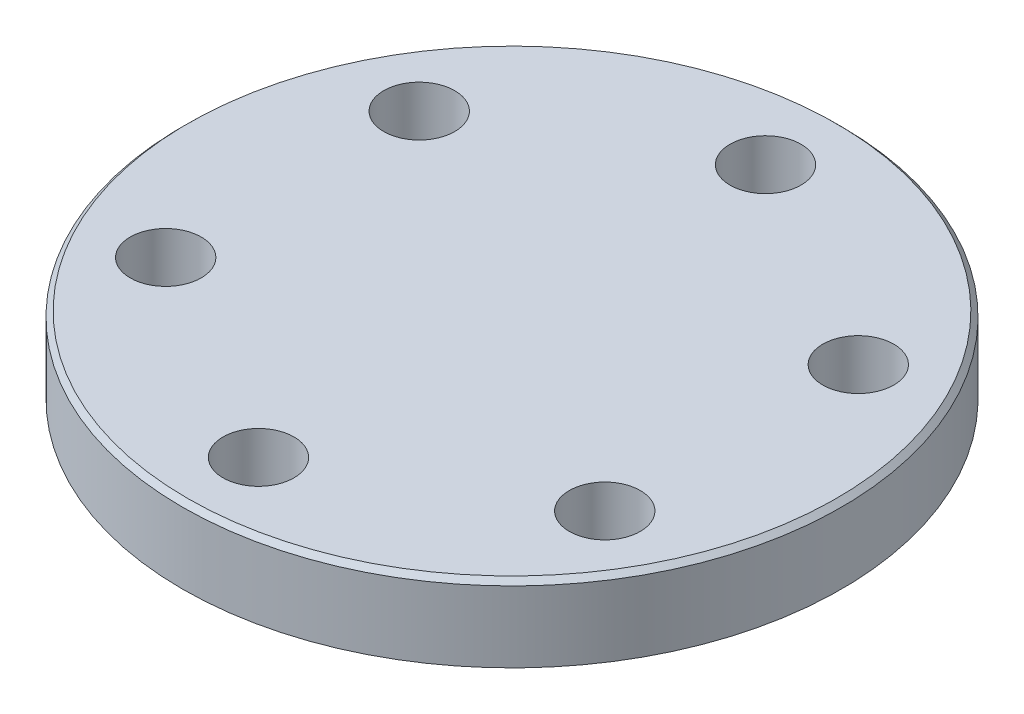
from build123d import *

# Parameters (mm, degrees)
ESQUISSE1_W                  = 65
ESQUISSE1_H                  = 15
CHANFREIN1_SIZE              = 1
ESQUISSE5_R                  = 7
ENL_V_MAT_EXTRU_2_DEPTH      = 94.139680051
R_P_TITION_CIRCULAIRE2_COUNT = 6


with BuildPart() as part:
    # Esquisse1 → Base-R_volution (revolve)
    with BuildSketch(Plane.XY, mode=Mode.PRIVATE) as base_r_volution_sk:
        with Locations((32.5, -837.5)):
            Rectangle(ESQUISSE1_W, ESQUISSE1_H)
    revolve(base_r_volution_sk.sketch.rotate(Axis((0, -775.6, 0), (0, 1, 0)), 90), axis=Axis((0, -775.6, 0), (0, 1, 0)))

    # Chanfrein1
    chanfrein1_edges = [part.edges().sort_by_distance(p)[0] for p in [
        (0, -830, 65),
    ]]
    chamfer(chanfrein1_edges, length=CHANFREIN1_SIZE)

    # Esquisse5 → Enl_v. mat.-Extru.2 (cut, through all)
    with BuildSketch(Plane(origin=(0, -830, 0), x_dir=(1, 0, 0), z_dir=(0, 1, 0))):
        with Locations(Location((0, 50, 0), (0, 0, 270))):
            Circle(ESQUISSE5_R)
    enl_v_mat_extru_2 = extrude(amount=-ENL_V_MAT_EXTRU_2_DEPTH, mode=Mode.SUBTRACT)

    # R_p_tition circulaire2: Enl_v. mat.-Extru.2 ×6 about axis
    r_p_tition_circulaire2_axis = Axis((0, 0, 0), (0, 1, 0))
    for i in range(1, R_P_TITION_CIRCULAIRE2_COUNT):
        add(enl_v_mat_extru_2.rotate(r_p_tition_circulaire2_axis, i * 360 / R_P_TITION_CIRCULAIRE2_COUNT), mode=Mode.SUBTRACT)


solid = part.part
